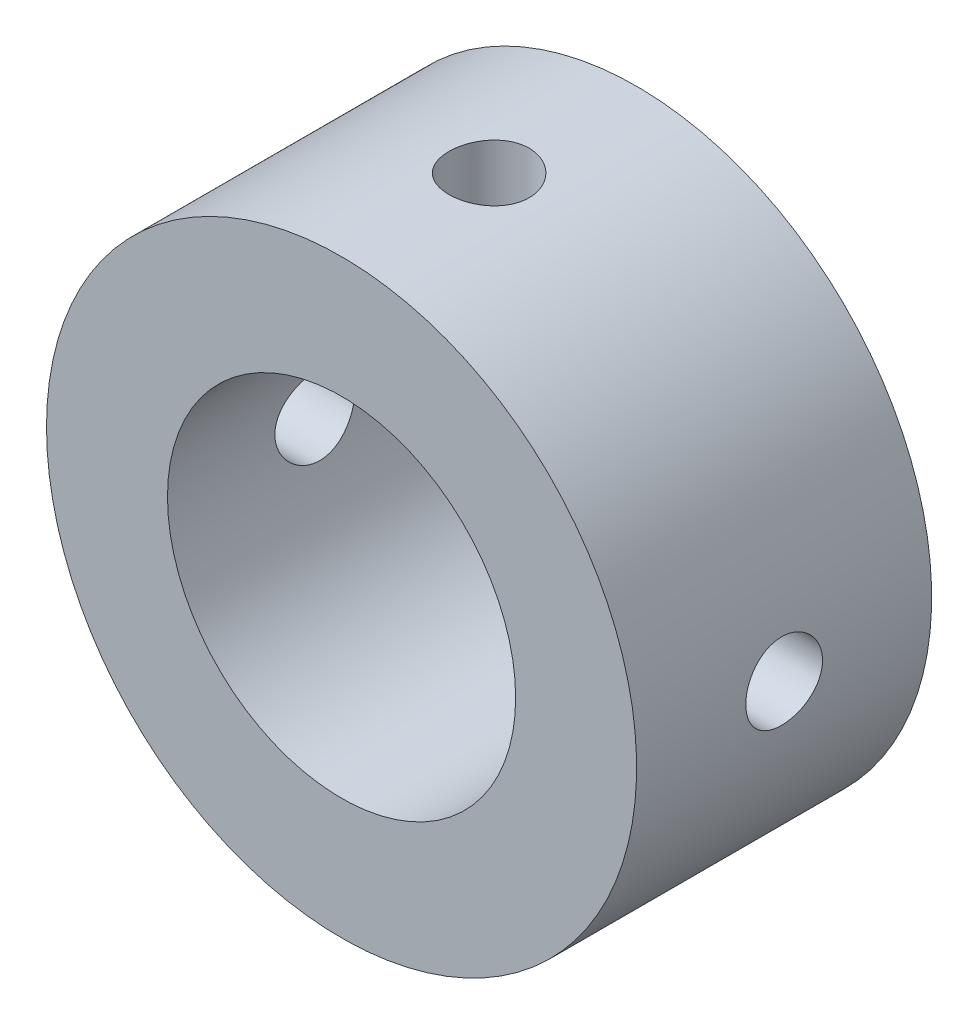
from build123d import *
from build123d.topology import SkipClean

# Parameters (mm, degrees)
SKETCH1_W                 = 25.4
SKETCH1_H                 = 25.4
BOSS_EXTRUDE1_DEPTH       = 12.7
F_8_32_TAPPED_HOLE1_D     = 3.4544
F_8_32_TAPPED_HOLE1_DEPTH = 12.7
F_8_32_TAPPED_HOLE1_TIP   = 1.037806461
F_8_32_TAPPED_HOLE2_D     = 3.4544
F_8_32_TAPPED_HOLE2_DEPTH = 12.7
F_8_32_TAPPED_HOLE2_TIP   = 1.037806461
M4X0_7_TAPPED_HOLE1_D     = 3.3
M4X0_7_TAPPED_HOLE1_DEPTH = 10.1000052
M4X0_7_TAPPED_HOLE1_TIP   = 0.991420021
SKETCH8_R                 = 7.493
CUT_EXTRUDE1_DEPTH        = 22.997045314


with BuildPart() as part:
    # Sketch1 → Boss-Extrude1 (new body)
    with BuildSketch(Plane.XY):
        Rectangle(SKETCH1_W, SKETCH1_H)
    extrude(amount=BOSS_EXTRUDE1_DEPTH)

    # 8-32 Tapped Hole1
    with Locations(Plane(origin=(0, 12.7, 0), x_dir=(1, 0, 0), z_dir=(0, 1, 0))):
        with Locations((0, -6.35)):
            Hole(F_8_32_TAPPED_HOLE1_D / 2, depth=F_8_32_TAPPED_HOLE1_DEPTH)
            with Locations((0, 0, -(F_8_32_TAPPED_HOLE1_DEPTH + F_8_32_TAPPED_HOLE1_TIP / 2))):  # 118° drill point
                Cone(0, F_8_32_TAPPED_HOLE1_D / 2, F_8_32_TAPPED_HOLE1_TIP, mode=Mode.SUBTRACT)

    # 8-32 Tapped Hole2
    with Locations(Plane.ZY.offset(12.7)):
        with Locations((6.35, 0)):
            Hole(F_8_32_TAPPED_HOLE2_D / 2, depth=F_8_32_TAPPED_HOLE2_DEPTH)
            with Locations((0, 0, -(F_8_32_TAPPED_HOLE2_DEPTH + F_8_32_TAPPED_HOLE2_TIP / 2))):  # 118° drill point
                Cone(0, F_8_32_TAPPED_HOLE2_D / 2, F_8_32_TAPPED_HOLE2_TIP, mode=Mode.SUBTRACT)

    # M4x0.7 Tapped Hole1
    with Locations(Plane(origin=(12.7, 0, 0), x_dir=(0, 0, -1), z_dir=(1, 0, 0))):
        with Locations((-6.35, 0)):
            Hole(M4X0_7_TAPPED_HOLE1_D / 2, depth=M4X0_7_TAPPED_HOLE1_DEPTH)
            with Locations((0, 0, -(M4X0_7_TAPPED_HOLE1_DEPTH + M4X0_7_TAPPED_HOLE1_TIP / 2))):  # 118° drill point
                Cone(0, M4X0_7_TAPPED_HOLE1_D / 2, M4X0_7_TAPPED_HOLE1_TIP, mode=Mode.SUBTRACT)

    # Sketch8 → Cut-Extrude1 (cut, through all)
    with SkipClean():  # the faces are left unmerged after this step: merging them gives an invalid solid
        with BuildSketch(Plane(origin=(0, 0, 0), x_dir=(-1, 0, 0), z_dir=(0, 0, -1))):
            Circle(SKETCH8_R)
            with BuildLine():
                Line((-12.7, 12.7), (-12.7, 0))
                ThreePointArc((-12.7, 0), (-8.980256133, 8.980256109), (-3.4e-08, 12.7))
                Line((-3.4e-08, 12.7), (-12.7, 12.7))
            make_face()
            with BuildLine():
                ThreePointArc((-3.4e-08, 12.7), (8.980256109, 8.980256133), (12.7, 0))
                Line((12.7, 0), (12.7, 12.7))
                Line((12.7, 12.7), (-3.4e-08, 12.7))
            make_face()
            with BuildLine():
                ThreePointArc((12.7, 0), (8.980256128, -8.980256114), (2e-08, -12.7))
                Line((2e-08, -12.7), (12.7, -12.7))
                Line((12.7, -12.7), (12.7, 0))
            make_face()
            with BuildLine():
                Line((-12.7, 0), (-12.7, -12.7))
                Line((-12.7, -12.7), (2e-08, -12.7))
                ThreePointArc((2e-08, -12.7), (-8.980256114, -8.980256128), (-12.7, 0))
            make_face()
        extrude(amount=-CUT_EXTRUDE1_DEPTH, mode=Mode.SUBTRACT)


solid = part.part
